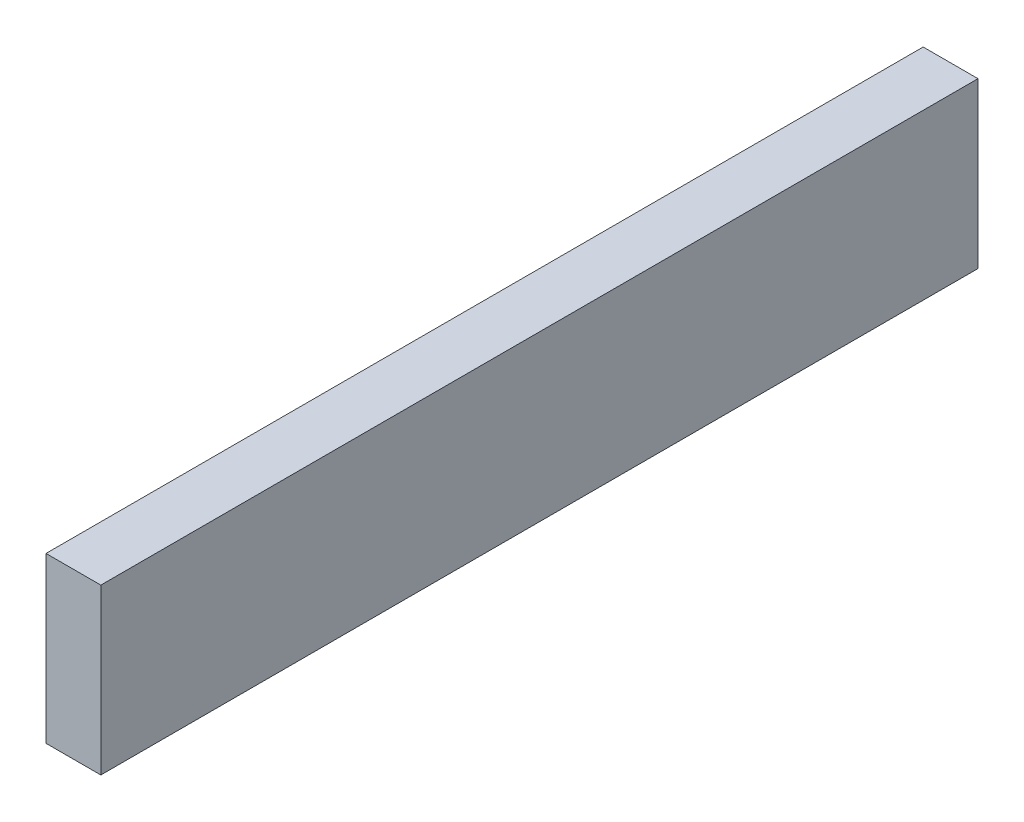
from build123d import *

# Parameters (mm, degrees)
SKETCH1_W           = 25.4
SKETCH1_H           = 76.2
BOSS_EXTRUDE1_DEPTH = 203.2


with BuildPart() as part:
    # Sketch1 → Boss-Extrude1 (new, symmetric)
    with BuildSketch(Plane.XY):
        Rectangle(SKETCH1_W, SKETCH1_H)
    extrude(amount=BOSS_EXTRUDE1_DEPTH, both=True)


solid = part.part
